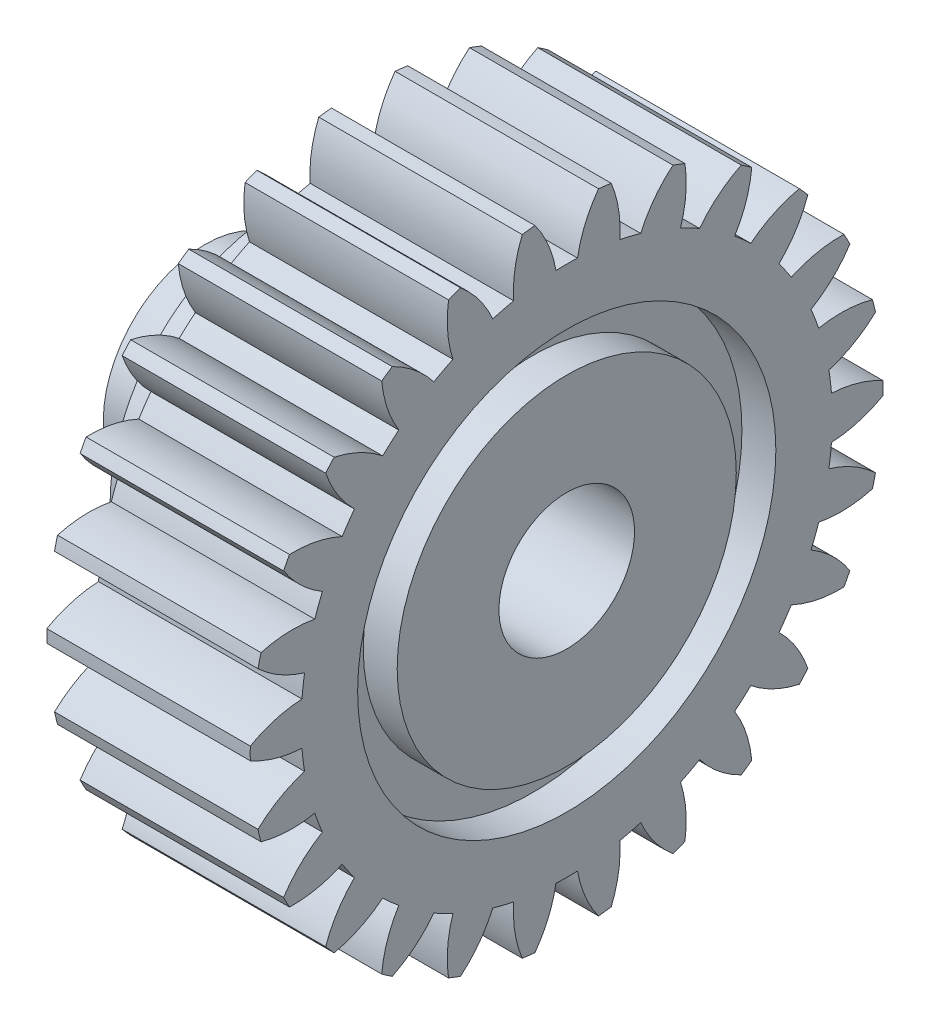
from build123d import *

# Parameters (mm, degrees)
BASPROSKE_W             = 9
BASPROSKE_H             = 14
TOOTHCUT_DEPTH          = 22.748563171
TEETHCUTS_COUNT         = 26
HUBNEAONESKE_R          = 7.5
HUBNEARONE_DEPTH        = 9.000051
BORSKE_R                = 3
BORE_DEPTH              = 9.000051
CUT_EXTRUDE1_DEPTH      = 22.703049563
CUT_EXTRUDE1_DEPTH_BACK = 22.703049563
SKETCH1_W               = 5.3000508
SKETCH1_H               = 15.02384493
SKETCH2_R               = 9.25
SKETCH2_R_2             = 7.5
CUT_EXTRUDE2_DEPTH      = 1.5
CUT_EXTRUDE3_START      = -7.5
SKETCH2_2_R             = 9.25
SKETCH2_2_R_2           = 7.5
CUT_EXTRUDE3_DEPTH      = 1.5
SKETCH3_R               = 4.5
SKETCH3_R_2             = 3
BOSS_EXTRUDE1_DEPTH     = 3.3


with BuildPart() as part:
    # BasProSke → Base-Revolve (revolve)
    with BuildSketch(Plane(origin=(0, 0, 0), x_dir=(1, 0, 0), z_dir=(0, 1, 0)), mode=Mode.PRIVATE) as base_revolve_sk:
        with Locations((4.5, 7)):
            Rectangle(BASPROSKE_W, BASPROSKE_H)
    revolve(base_revolve_sk.sketch.rotate(Axis((-10, 0, 0), (1, 0, 0)), 180), axis=Axis((-10, 0, 0), (1, 0, 0)))

    # TooCutSke → ToothCut (cut, through all)
    with BuildSketch(Plane(origin=(0, 0, 0), x_dir=(0, 0, -1), z_dir=(1, 0, 0))):
        with BuildLine():
            ThreePointArc((0.476965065, 11.739314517), (0, 11.749), (-0.476965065, 11.739314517))
            ThreePointArc((-0.476965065, 11.739314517), (-0.82065865, 12.901686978), (-1.424117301, 13.952911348))
            ThreePointArc((-1.424117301, 13.952911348), (0, 14.0254), (1.424117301, 13.952911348))
            ThreePointArc((1.424117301, 13.952911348), (0.82065865, 12.901686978), (0.476965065, 11.739314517))
        make_face()
    toothcut = extrude(amount=TOOTHCUT_DEPTH, mode=Mode.SUBTRACT)

    # TeethCuts: ToothCut ×26 about axis
    teethcuts_axis = Axis((0, 0, 0), (1, 0, 0))
    for i in range(1, TEETHCUTS_COUNT):
        add(toothcut.rotate(teethcuts_axis, i * 360 / TEETHCUTS_COUNT), mode=Mode.SUBTRACT)

    # HubNeaOneSke → HubNearOne (add)
    with BuildSketch(Plane.ZY):
        with Locations(Location((0, 0, 0), (0, 0, 180))):
            Circle(HUBNEAONESKE_R)
    extrude(amount=HUBNEARONE_DEPTH)

    # BorSke → Bore (cut, symmetric)
    with BuildSketch(Plane(origin=(0, 0, 0), x_dir=(0, 0, -1), z_dir=(1, 0, 0))):
        with Locations(Location((0, 0, 0), (0, 0, 180))):
            Circle(BORSKE_R)
    extrude(amount=BORE_DEPTH, both=True, mode=Mode.SUBTRACT)

    # Sketch1 → Cut-Extrude1 (cut, two sides: drawn at the far end of the back side and taken through both)
    with BuildSketch(Plane.XY.offset(-CUT_EXTRUDE1_DEPTH_BACK)):
        with Locations((-6.3500254, -0.011922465)):
            Rectangle(SKETCH1_W, SKETCH1_H)
    extrude(amount=CUT_EXTRUDE1_DEPTH + CUT_EXTRUDE1_DEPTH_BACK, mode=Mode.SUBTRACT)

    # Sketch2 → Cut-Extrude2 (cut)
    with BuildSketch(Plane(origin=(9, 0, 0), x_dir=(0, 0, -1), z_dir=(1, 0, 0))):
        Circle(SKETCH2_R)
        Circle(SKETCH2_R_2, mode=Mode.SUBTRACT)
    extrude(amount=-CUT_EXTRUDE2_DEPTH, mode=Mode.SUBTRACT)

    # Sketch2_2 → Cut-Extrude3 (cut)
    with BuildSketch(Plane(origin=(9, 0, 0), x_dir=(0, 0, -1), z_dir=(1, 0, 0)).offset(CUT_EXTRUDE3_START)):
        Circle(SKETCH2_2_R)
        Circle(SKETCH2_2_R_2, mode=Mode.SUBTRACT)
    extrude(amount=-CUT_EXTRUDE3_DEPTH, mode=Mode.SUBTRACT)

    # Sketch3 → Boss-Extrude1 (add)
    with BuildSketch(Plane.ZY.offset(3.7)):
        with Locations(Location((0, 0, 0), (0, 0, 90))):
            Circle(SKETCH3_R)
        Circle(SKETCH3_R_2, mode=Mode.SUBTRACT)
    extrude(amount=BOSS_EXTRUDE1_DEPTH)


solid = part.part
